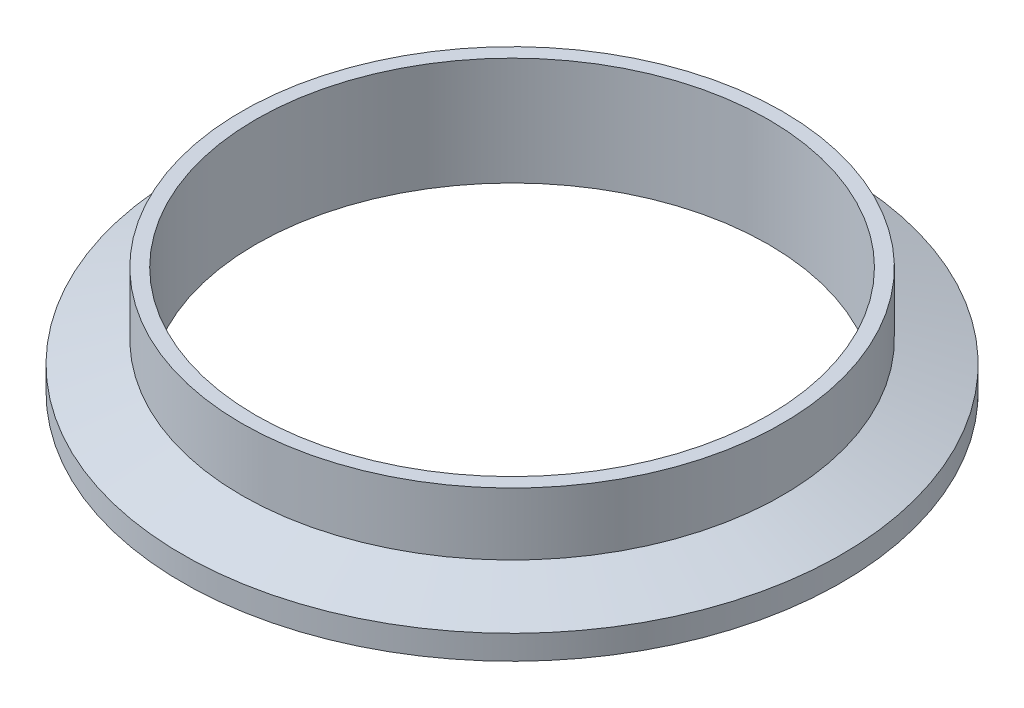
from build123d import *


with BuildPart() as part:
    # Sketch1 → Revolve2 (revolve)
    with BuildSketch(Plane.XY, mode=Mode.PRIVATE) as revolve2_sk:
        with BuildLine():
            Line((-30.099, 0), (-30.099, 12.7))
            Line((-30.099, 12.7), (-31.75, 12.7))
            Line((-31.75, 12.7), (-31.75, 5.377887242))
            Line((-31.75, 5.377887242), (-38.7096, 2.8448))
            Line((-38.7096, 2.8448), (-38.7096, 0))
            Line((-38.7096, 0), (-37.136708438, 0))
            ThreePointArc((-37.136708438, 0), (-36.704511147, 0.129217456), (-36.414166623, 0.474458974))
            ThreePointArc((-36.414166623, 0.474458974), (-35.3187, 1.1938), (-34.223233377, 0.474458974))
            ThreePointArc((-34.223233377, 0.474458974), (-33.932888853, 0.129217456), (-33.500691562, 0))
            Line((-33.500691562, 0), (-30.099, 0))
        make_face()
    revolve(revolve2_sk.sketch.rotate(Axis((0, 0, 0), (0, 1, 0)), 270), axis=Axis((0, 0, 0), (0, 1, 0)))


solid = part.part
